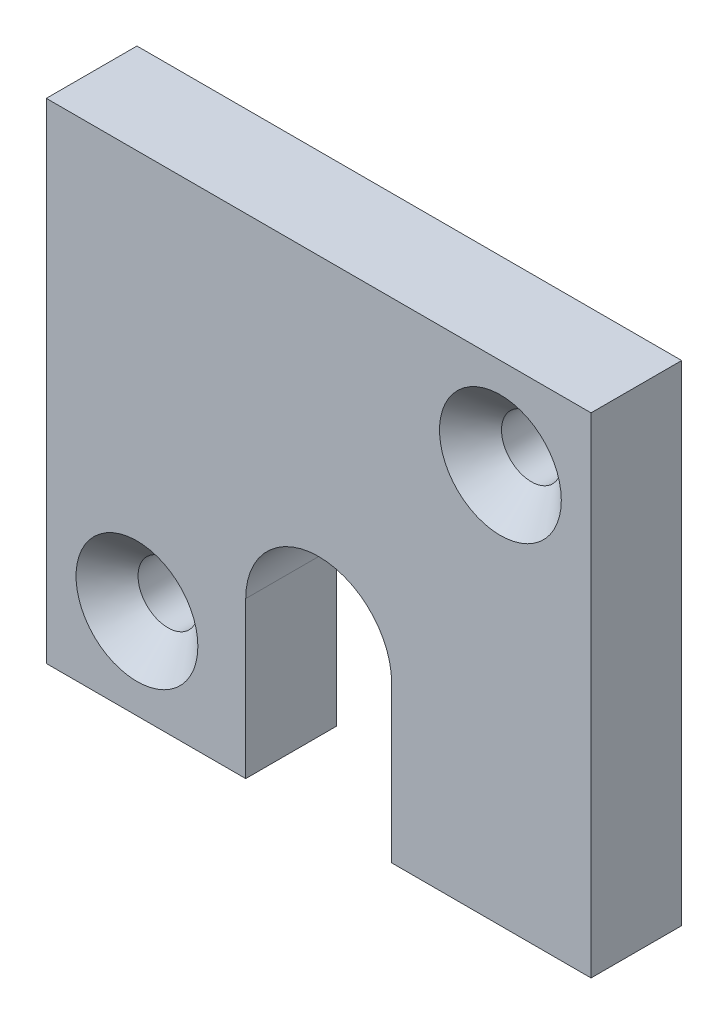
from build123d import *

# Parameters (mm, degrees)
BASE_EXTRUSION_DEPTH          = 10
CSK_FOR_M6_SFHCS2_D           = 6.6
CSK_FOR_M6_SFHCS2_CSINK_D     = 13.44
CSK_FOR_M6_SFHCS2_CSINK_ANGLE = 90
CSK_FOR_M6_SFHCS1_D           = 6.6
CSK_FOR_M6_SFHCS1_CSINK_D     = 13.44
CSK_FOR_M6_SFHCS1_CSINK_ANGLE = 90


with BuildPart() as part:
    # Esquisse1 → Base-Extrusion (new body)
    with BuildSketch(Plane.XY):
        with BuildLine():
            Line((38.1, 0), (60.1, 0))
            Line((60.1, 0), (60.1, 54))
            Line((60.1, 54), (0, 54))
            Line((0, 54), (0, 0))
            Line((0, 0), (22, 0))
            Line((22, 0), (22, 17.2))
            ThreePointArc((22, 17.2), (30.05, 25.25), (38.1, 17.2))
            Line((38.1, 17.2), (38.1, 0))
        make_face()
    extrude(amount=BASE_EXTRUSION_DEPTH)

    # CSK for M6 SFHCS2 (through all)
    with Locations(Plane.XY.offset(10)):
        with Locations((50.1, 44)):
            CounterSinkHole(CSK_FOR_M6_SFHCS2_D / 2, CSK_FOR_M6_SFHCS2_CSINK_D / 2, counter_sink_angle=CSK_FOR_M6_SFHCS2_CSINK_ANGLE)

    # CSK for M6 SFHCS1 (through all)
    with Locations(Plane.XY.offset(10)):
        with Locations((10, 10)):
            CounterSinkHole(CSK_FOR_M6_SFHCS1_D / 2, CSK_FOR_M6_SFHCS1_CSINK_D / 2, counter_sink_angle=CSK_FOR_M6_SFHCS1_CSINK_ANGLE)


solid = part.part
